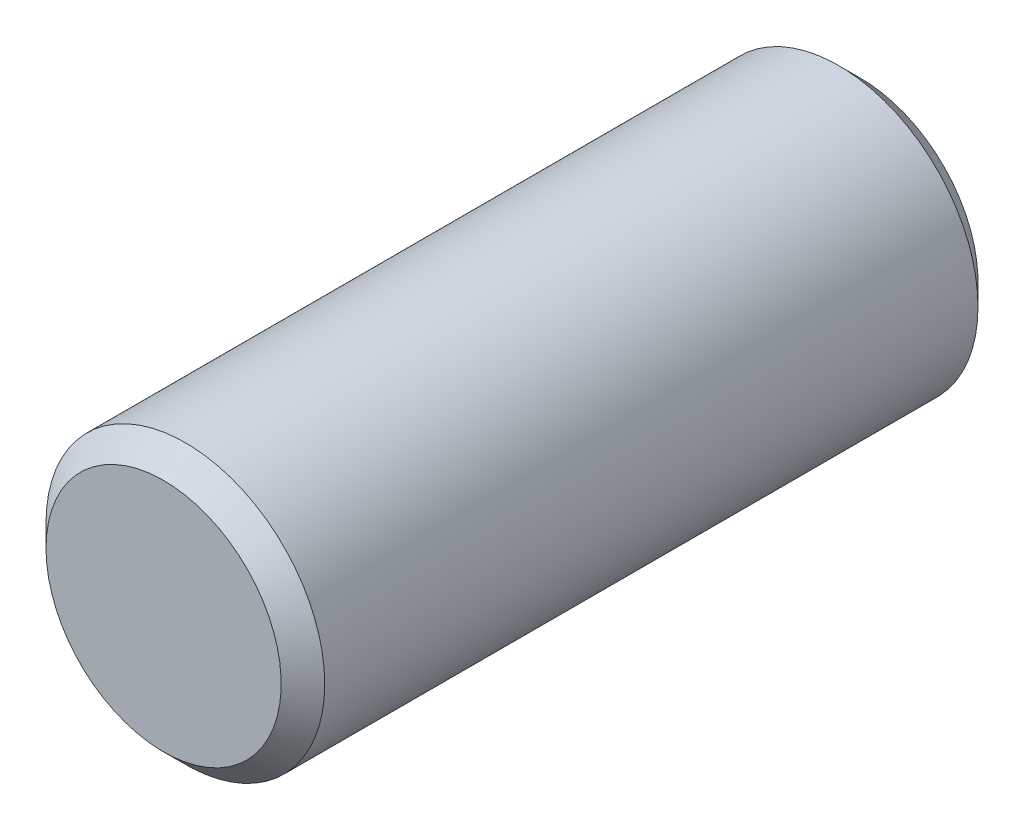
ISO-10303-21;
HEADER;
FILE_DESCRIPTION(('STEP AP214'),'2;1');
FILE_NAME('part.step','',(''),(''),'','','');
FILE_SCHEMA(('AUTOMOTIVE_DESIGN { 1 0 10303 214 1 1 1 1 }'));
ENDSEC;
DATA;
#1=APPLICATION_CONTEXT('core data for automotive mechanical design processes');
#2=APPLICATION_PROTOCOL_DEFINITION('international standard','automotive_design',2000,#1);
#3=PRODUCT_CONTEXT('',#1,'mechanical');
#4=PRODUCT('Part','Part','',(#3));
#5=PRODUCT_RELATED_PRODUCT_CATEGORY('part','',(#4));
#6=PRODUCT_DEFINITION_FORMATION('','',#4);
#7=PRODUCT_DEFINITION_CONTEXT('part definition',#1,'design');
#8=PRODUCT_DEFINITION('design','',#6,#7);
#9=PRODUCT_DEFINITION_SHAPE('','',#8);
#10=(LENGTH_UNIT() NAMED_UNIT(*) SI_UNIT(.MILLI.,.METRE.));
#11=(NAMED_UNIT(*) PLANE_ANGLE_UNIT() SI_UNIT($,.RADIAN.));
#12=(NAMED_UNIT(*) SI_UNIT($,.STERADIAN.) SOLID_ANGLE_UNIT());
#13=UNCERTAINTY_MEASURE_WITH_UNIT(LENGTH_MEASURE(1.E-05),#10,'distance_accuracy_value','');
#14=(GEOMETRIC_REPRESENTATION_CONTEXT(3) GLOBAL_UNCERTAINTY_ASSIGNED_CONTEXT((#13)) GLOBAL_UNIT_ASSIGNED_CONTEXT((#10,
#11,#12)) REPRESENTATION_CONTEXT('',''));
#15=CARTESIAN_POINT('',(0.,0.,0.));
#16=DIRECTION('',(0.,0.,1.));
#17=DIRECTION('',(1.,0.,0.));
#18=AXIS2_PLACEMENT_3D('',#15,#16,#17);
#19=CARTESIAN_POINT('',(0.,0.,0.));
#20=DIRECTION('',(0.,0.,-1.));
#21=DIRECTION('',(-1.,0.,0.));
#22=AXIS2_PLACEMENT_3D('',#19,#20,#21);
#23=PLANE('',#22);
#24=CARTESIAN_POINT('',(0.,0.,0.));
#25=DIRECTION('',(0.,0.,-1.));
#26=DIRECTION('',(-1.,0.,0.));
#27=AXIS2_PLACEMENT_3D('',#24,#25,#26);
#28=CIRCLE('',#27,3.375);
#29=CARTESIAN_POINT('',(-3.375,0.,0.));
#30=VERTEX_POINT('',#29);
#31=EDGE_CURVE('E11',#30,#30,#28,.T.);
#32=ORIENTED_EDGE('',*,*,#31,.T.);
#33=EDGE_LOOP('',(#32));
#34=FACE_BOUND('',#33,.T.);
#35=DIRECTION('',(0.866025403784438,-0.500000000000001,0.));
#36=VECTOR('',#35,1.);
#37=CARTESIAN_POINT('',(0.,2.29,0.));
#38=LINE('',#37,#36);
#39=CARTESIAN_POINT('',(0.,2.29,0.));
#40=VERTEX_POINT('',#39);
#41=CARTESIAN_POINT('',(1.98319817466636,1.145,0.));
#42=VERTEX_POINT('',#41);
#43=EDGE_CURVE('E107',#40,#42,#38,.T.);
#44=ORIENTED_EDGE('',*,*,#43,.F.);
#45=DIRECTION('',(-0.866025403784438,-0.500000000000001,0.));
#46=VECTOR('',#45,1.);
#47=CARTESIAN_POINT('',(0.,2.29,0.));
#48=LINE('',#47,#46);
#49=CARTESIAN_POINT('',(-1.98319817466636,1.145,0.));
#50=VERTEX_POINT('',#49);
#51=EDGE_CURVE('E43',#40,#50,#48,.T.);
#52=ORIENTED_EDGE('',*,*,#51,.T.);
#53=DIRECTION('',(0.,-1.,0.));
#54=VECTOR('',#53,1.);
#55=CARTESIAN_POINT('',(-1.98319817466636,1.145,0.));
#56=LINE('',#55,#54);
#57=CARTESIAN_POINT('',(-1.98319817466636,-1.145,0.));
#58=VERTEX_POINT('',#57);
#59=EDGE_CURVE('E187',#50,#58,#56,.T.);
#60=ORIENTED_EDGE('',*,*,#59,.T.);
#61=DIRECTION('',(0.866025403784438,-0.500000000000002,0.));
#62=VECTOR('',#61,1.);
#63=CARTESIAN_POINT('',(-1.98319817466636,-1.145,0.));
#64=LINE('',#63,#62);
#65=CARTESIAN_POINT('',(0.,-2.29,0.));
#66=VERTEX_POINT('',#65);
#67=EDGE_CURVE('E186',#58,#66,#64,.T.);
#68=ORIENTED_EDGE('',*,*,#67,.T.);
#69=DIRECTION('',(-0.866025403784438,-0.5,0.));
#70=VECTOR('',#69,1.);
#71=CARTESIAN_POINT('',(1.98319817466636,-1.145,0.));
#72=LINE('',#71,#70);
#73=CARTESIAN_POINT('',(1.98319817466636,-1.145,0.));
#74=VERTEX_POINT('',#73);
#75=EDGE_CURVE('E168',#74,#66,#72,.T.);
#76=ORIENTED_EDGE('',*,*,#75,.F.);
#77=DIRECTION('',(0.,-1.,0.));
#78=VECTOR('',#77,1.);
#79=CARTESIAN_POINT('',(1.98319817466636,1.145,0.));
#80=LINE('',#79,#78);
#81=EDGE_CURVE('E162',#42,#74,#80,.T.);
#82=ORIENTED_EDGE('',*,*,#81,.F.);
#83=EDGE_LOOP('',(#44,#52,#60,#68,#76,#82));
#84=FACE_BOUND('',#83,.T.);
#85=ADVANCED_FACE('F29',(#34,#84),#23,.T.);
#86=CARTESIAN_POINT('',(0.,0.,0.));
#87=DIRECTION('',(0.,0.,1.));
#88=DIRECTION('',(1.,0.,0.));
#89=AXIS2_PLACEMENT_3D('',#86,#87,#88);
#90=CONICAL_SURFACE('',#89,3.375,0.78539816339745);
#91=CARTESIAN_POINT('',(0.,0.,0.625));
#92=DIRECTION('',(0.,0.,-1.));
#93=DIRECTION('',(-1.,0.,0.));
#94=AXIS2_PLACEMENT_3D('',#91,#92,#93);
#95=CIRCLE('',#94,4.);
#96=CARTESIAN_POINT('',(-4.,0.,0.625));
#97=VERTEX_POINT('',#96);
#98=EDGE_CURVE('E36',#97,#97,#95,.T.);
#99=ORIENTED_EDGE('',*,*,#98,.T.);
#100=EDGE_LOOP('',(#99));
#101=FACE_BOUND('',#100,.T.);
#102=ORIENTED_EDGE('',*,*,#31,.F.);
#103=EDGE_LOOP('',(#102));
#104=FACE_BOUND('',#103,.T.);
#105=ADVANCED_FACE('F139',(#101,#104),#90,.T.);
#106=CARTESIAN_POINT('',(0.,0.,-10.));
#107=DIRECTION('',(0.,0.,-1.));
#108=DIRECTION('',(-1.,0.,0.));
#109=AXIS2_PLACEMENT_3D('',#106,#107,#108);
#110=CYLINDRICAL_SURFACE('',#109,4.);
#111=CARTESIAN_POINT('',(0.,0.,19.375));
#112=DIRECTION('',(0.,0.,-1.));
#113=DIRECTION('',(-1.,0.,0.));
#114=AXIS2_PLACEMENT_3D('',#111,#112,#113);
#115=CIRCLE('',#114,4.);
#116=CARTESIAN_POINT('',(-4.,0.,19.375));
#117=VERTEX_POINT('',#116);
#118=EDGE_CURVE('E134',#117,#117,#115,.T.);
#119=ORIENTED_EDGE('',*,*,#118,.T.);
#120=EDGE_LOOP('',(#119));
#121=FACE_BOUND('',#120,.T.);
#122=ORIENTED_EDGE('',*,*,#98,.F.);
#123=EDGE_LOOP('',(#122));
#124=FACE_BOUND('',#123,.T.);
#125=ADVANCED_FACE('F142',(#121,#124),#110,.T.);
#126=CARTESIAN_POINT('',(0.,0.,19.375));
#127=DIRECTION('',(0.,0.,-1.));
#128=DIRECTION('',(-1.,0.,0.));
#129=AXIS2_PLACEMENT_3D('',#126,#127,#128);
#130=CONICAL_SURFACE('',#129,4.,0.785398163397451);
#131=CARTESIAN_POINT('',(0.,0.,20.));
#132=DIRECTION('',(0.,0.,-1.));
#133=DIRECTION('',(-1.,0.,0.));
#134=AXIS2_PLACEMENT_3D('',#131,#132,#133);
#135=CIRCLE('',#134,3.375);
#136=CARTESIAN_POINT('',(-3.375,0.,20.));
#137=VERTEX_POINT('',#136);
#138=EDGE_CURVE('E131',#137,#137,#135,.T.);
#139=ORIENTED_EDGE('',*,*,#138,.T.);
#140=EDGE_LOOP('',(#139));
#141=FACE_BOUND('',#140,.T.);
#142=ORIENTED_EDGE('',*,*,#118,.F.);
#143=EDGE_LOOP('',(#142));
#144=FACE_BOUND('',#143,.T.);
#145=ADVANCED_FACE('F144',(#141,#144),#130,.T.);
#146=CARTESIAN_POINT('',(3.375,0.,20.));
#147=DIRECTION('',(0.,0.,1.));
#148=DIRECTION('',(1.,0.,0.));
#149=AXIS2_PLACEMENT_3D('',#146,#147,#148);
#150=PLANE('',#149);
#151=ORIENTED_EDGE('',*,*,#138,.F.);
#152=EDGE_LOOP('',(#151));
#153=FACE_BOUND('',#152,.T.);
#154=ADVANCED_FACE('F151',(#153),#150,.T.);
#155=CARTESIAN_POINT('',(0.,2.29,4.5));
#156=DIRECTION('',(0.500000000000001,-0.866025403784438,0.));
#157=DIRECTION('',(0.866025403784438,0.500000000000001,0.));
#158=AXIS2_PLACEMENT_3D('',#155,#156,#157);
#159=PLANE('',#158);
#160=ORIENTED_EDGE('',*,*,#51,.F.);
#161=DIRECTION('',(0.,0.,-1.));
#162=VECTOR('',#161,1.);
#163=CARTESIAN_POINT('',(0.,2.29,4.5));
#164=LINE('',#163,#162);
#165=CARTESIAN_POINT('',(0.,2.29,4.5));
#166=VERTEX_POINT('',#165);
#167=EDGE_CURVE('E101',#166,#40,#164,.T.);
#168=ORIENTED_EDGE('',*,*,#167,.F.);
#169=DIRECTION('',(-0.866025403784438,-0.500000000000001,0.));
#170=VECTOR('',#169,1.);
#171=CARTESIAN_POINT('',(0.,2.29,4.5));
#172=LINE('',#171,#170);
#173=CARTESIAN_POINT('',(-1.98319817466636,1.145,4.5));
#174=VERTEX_POINT('',#173);
#175=EDGE_CURVE('E163',#166,#174,#172,.T.);
#176=ORIENTED_EDGE('',*,*,#175,.T.);
#177=DIRECTION('',(0.,0.,-1.));
#178=VECTOR('',#177,1.);
#179=CARTESIAN_POINT('',(-1.98319817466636,1.145,4.5));
#180=LINE('',#179,#178);
#181=EDGE_CURVE('E129',#174,#50,#180,.T.);
#182=ORIENTED_EDGE('',*,*,#181,.T.);
#183=EDGE_LOOP('',(#160,#168,#176,#182));
#184=FACE_BOUND('',#183,.T.);
#185=ADVANCED_FACE('F208',(#184),#159,.T.);
#186=CARTESIAN_POINT('',(-1.98319817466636,1.145,4.5));
#187=DIRECTION('',(1.,0.,0.));
#188=DIRECTION('',(0.,0.,-1.));
#189=AXIS2_PLACEMENT_3D('',#186,#187,#188);
#190=PLANE('',#189);
#191=ORIENTED_EDGE('',*,*,#59,.F.);
#192=ORIENTED_EDGE('',*,*,#181,.F.);
#193=DIRECTION('',(0.,-1.,0.));
#194=VECTOR('',#193,1.);
#195=CARTESIAN_POINT('',(-1.98319817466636,1.145,4.5));
#196=LINE('',#195,#194);
#197=CARTESIAN_POINT('',(-1.98319817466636,-1.145,4.5));
#198=VERTEX_POINT('',#197);
#199=EDGE_CURVE('E166',#174,#198,#196,.T.);
#200=ORIENTED_EDGE('',*,*,#199,.T.);
#201=DIRECTION('',(0.,0.,-1.));
#202=VECTOR('',#201,1.);
#203=CARTESIAN_POINT('',(-1.98319817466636,-1.145,4.5));
#204=LINE('',#203,#202);
#205=EDGE_CURVE('E127',#198,#58,#204,.T.);
#206=ORIENTED_EDGE('',*,*,#205,.T.);
#207=EDGE_LOOP('',(#191,#192,#200,#206));
#208=FACE_BOUND('',#207,.T.);
#209=ADVANCED_FACE('F209',(#208),#190,.T.);
#210=CARTESIAN_POINT('',(-1.98319817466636,-1.145,4.5));
#211=DIRECTION('',(0.500000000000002,0.866025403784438,0.));
#212=DIRECTION('',(-0.866025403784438,0.500000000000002,0.));
#213=AXIS2_PLACEMENT_3D('',#210,#211,#212);
#214=PLANE('',#213);
#215=ORIENTED_EDGE('',*,*,#67,.F.);
#216=ORIENTED_EDGE('',*,*,#205,.F.);
#217=DIRECTION('',(0.866025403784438,-0.500000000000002,0.));
#218=VECTOR('',#217,1.);
#219=CARTESIAN_POINT('',(-1.98319817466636,-1.145,4.5));
#220=LINE('',#219,#218);
#221=CARTESIAN_POINT('',(0.,-2.29,4.5));
#222=VERTEX_POINT('',#221);
#223=EDGE_CURVE('E119',#198,#222,#220,.T.);
#224=ORIENTED_EDGE('',*,*,#223,.T.);
#225=DIRECTION('',(0.,0.,-1.));
#226=VECTOR('',#225,1.);
#227=CARTESIAN_POINT('',(0.,-2.29,4.5));
#228=LINE('',#227,#226);
#229=EDGE_CURVE('E125',#222,#66,#228,.T.);
#230=ORIENTED_EDGE('',*,*,#229,.T.);
#231=EDGE_LOOP('',(#215,#216,#224,#230));
#232=FACE_BOUND('',#231,.T.);
#233=ADVANCED_FACE('F178',(#232),#214,.T.);
#234=CARTESIAN_POINT('',(1.98319817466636,-1.145,4.5));
#235=DIRECTION('',(0.5,-0.866025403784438,0.));
#236=DIRECTION('',(0.866025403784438,0.5,0.));
#237=AXIS2_PLACEMENT_3D('',#234,#235,#236);
#238=PLANE('',#237);
#239=ORIENTED_EDGE('',*,*,#75,.T.);
#240=ORIENTED_EDGE('',*,*,#229,.F.);
#241=DIRECTION('',(-0.866025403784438,-0.5,0.));
#242=VECTOR('',#241,1.);
#243=CARTESIAN_POINT('',(1.98319817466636,-1.145,4.5));
#244=LINE('',#243,#242);
#245=CARTESIAN_POINT('',(1.98319817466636,-1.145,4.5));
#246=VERTEX_POINT('',#245);
#247=EDGE_CURVE('E116',#246,#222,#244,.T.);
#248=ORIENTED_EDGE('',*,*,#247,.F.);
#249=DIRECTION('',(0.,0.,-1.));
#250=VECTOR('',#249,1.);
#251=CARTESIAN_POINT('',(1.98319817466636,-1.145,4.5));
#252=LINE('',#251,#250);
#253=EDGE_CURVE('E111',#246,#74,#252,.T.);
#254=ORIENTED_EDGE('',*,*,#253,.T.);
#255=EDGE_LOOP('',(#239,#240,#248,#254));
#256=FACE_BOUND('',#255,.T.);
#257=ADVANCED_FACE('F184',(#256),#238,.F.);
#258=CARTESIAN_POINT('',(1.98319817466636,1.145,4.5));
#259=DIRECTION('',(1.,0.,0.));
#260=DIRECTION('',(0.,0.,-1.));
#261=AXIS2_PLACEMENT_3D('',#258,#259,#260);
#262=PLANE('',#261);
#263=ORIENTED_EDGE('',*,*,#81,.T.);
#264=ORIENTED_EDGE('',*,*,#253,.F.);
#265=DIRECTION('',(0.,-1.,0.));
#266=VECTOR('',#265,1.);
#267=CARTESIAN_POINT('',(1.98319817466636,1.145,4.5));
#268=LINE('',#267,#266);
#269=CARTESIAN_POINT('',(1.98319817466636,1.145,4.5));
#270=VERTEX_POINT('',#269);
#271=EDGE_CURVE('E51',#270,#246,#268,.T.);
#272=ORIENTED_EDGE('',*,*,#271,.F.);
#273=DIRECTION('',(0.,0.,-1.));
#274=VECTOR('',#273,1.);
#275=CARTESIAN_POINT('',(1.98319817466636,1.145,4.5));
#276=LINE('',#275,#274);
#277=EDGE_CURVE('E104',#270,#42,#276,.T.);
#278=ORIENTED_EDGE('',*,*,#277,.T.);
#279=EDGE_LOOP('',(#263,#264,#272,#278));
#280=FACE_BOUND('',#279,.T.);
#281=ADVANCED_FACE('F114',(#280),#262,.F.);
#282=CARTESIAN_POINT('',(0.,2.29,4.5));
#283=DIRECTION('',(0.500000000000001,0.866025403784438,0.));
#284=DIRECTION('',(-0.866025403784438,0.500000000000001,0.));
#285=AXIS2_PLACEMENT_3D('',#282,#283,#284);
#286=PLANE('',#285);
#287=ORIENTED_EDGE('',*,*,#43,.T.);
#288=ORIENTED_EDGE('',*,*,#277,.F.);
#289=DIRECTION('',(0.866025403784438,-0.500000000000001,0.));
#290=VECTOR('',#289,1.);
#291=CARTESIAN_POINT('',(0.,2.29,4.5));
#292=LINE('',#291,#290);
#293=EDGE_CURVE('E94',#166,#270,#292,.T.);
#294=ORIENTED_EDGE('',*,*,#293,.F.);
#295=ORIENTED_EDGE('',*,*,#167,.T.);
#296=EDGE_LOOP('',(#287,#288,#294,#295));
#297=FACE_BOUND('',#296,.T.);
#298=ADVANCED_FACE('F105',(#297),#286,.F.);
#299=CARTESIAN_POINT('',(0.,2.29,4.5));
#300=DIRECTION('',(0.122234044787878,-0.211715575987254,-0.969657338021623));
#301=DIRECTION('',(0.,0.976983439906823,-0.213315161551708));
#302=AXIS2_PLACEMENT_3D('',#299,#300,#301);
#303=PLANE('',#302);
#304=DIRECTION('',(0.,0.976983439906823,-0.213315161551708));
#305=VECTOR('',#304,1.);
#306=CARTESIAN_POINT('',(0.,0.,5.));
#307=LINE('',#306,#305);
#308=CARTESIAN_POINT('',(0.,0.,5.));
#309=VERTEX_POINT('',#308);
#310=EDGE_CURVE('E98',#309,#166,#307,.T.);
#311=ORIENTED_EDGE('',*,*,#310,.F.);
#312=DIRECTION('',(-0.846092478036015,0.488491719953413,-0.213315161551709));
#313=VECTOR('',#312,1.);
#314=CARTESIAN_POINT('',(0.,0.,5.));
#315=LINE('',#314,#313);
#316=EDGE_CURVE('E192',#309,#174,#315,.T.);
#317=ORIENTED_EDGE('',*,*,#316,.T.);
#318=ORIENTED_EDGE('',*,*,#175,.F.);
#319=EDGE_LOOP('',(#311,#317,#318));
#320=FACE_BOUND('',#319,.T.);
#321=ADVANCED_FACE('F200',(#320),#303,.T.);
#322=CARTESIAN_POINT('',(-1.98319817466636,1.145,4.5));
#323=DIRECTION('',(0.244468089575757,0.,-0.969657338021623));
#324=DIRECTION('',(-0.969657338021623,0.,-0.244468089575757));
#325=AXIS2_PLACEMENT_3D('',#322,#323,#324);
#326=PLANE('',#325);
#327=ORIENTED_EDGE('',*,*,#316,.F.);
#328=DIRECTION('',(-0.846092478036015,-0.488491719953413,-0.213315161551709));
#329=VECTOR('',#328,1.);
#330=CARTESIAN_POINT('',(0.,0.,5.));
#331=LINE('',#330,#329);
#332=EDGE_CURVE('E90',#309,#198,#331,.T.);
#333=ORIENTED_EDGE('',*,*,#332,.T.);
#334=ORIENTED_EDGE('',*,*,#199,.F.);
#335=EDGE_LOOP('',(#327,#333,#334));
#336=FACE_BOUND('',#335,.T.);
#337=ADVANCED_FACE('F205',(#336),#326,.T.);
#338=CARTESIAN_POINT('',(1.98319817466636,1.145,4.5));
#339=DIRECTION('',(-0.122234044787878,-0.211715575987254,-0.969657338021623));
#340=DIRECTION('',(0.,0.976983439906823,-0.213315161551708));
#341=AXIS2_PLACEMENT_3D('',#338,#339,#340);
#342=PLANE('',#341);
#343=DIRECTION('',(0.846092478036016,0.488491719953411,-0.213315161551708));
#344=VECTOR('',#343,1.);
#345=CARTESIAN_POINT('',(0.,0.,5.));
#346=LINE('',#345,#344);
#347=EDGE_CURVE('E84',#309,#270,#346,.T.);
#348=ORIENTED_EDGE('',*,*,#347,.F.);
#349=ORIENTED_EDGE('',*,*,#310,.T.);
#350=ORIENTED_EDGE('',*,*,#293,.T.);
#351=EDGE_LOOP('',(#348,#349,#350));
#352=FACE_BOUND('',#351,.T.);
#353=ADVANCED_FACE('F96',(#352),#342,.T.);
#354=CARTESIAN_POINT('',(-1.98319817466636,-1.145,4.5));
#355=DIRECTION('',(0.122234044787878,0.211715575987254,-0.969657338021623));
#356=DIRECTION('',(0.,0.976983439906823,0.213315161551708));
#357=AXIS2_PLACEMENT_3D('',#354,#355,#356);
#358=PLANE('',#357);
#359=ORIENTED_EDGE('',*,*,#332,.F.);
#360=DIRECTION('',(0.,-0.976983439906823,-0.213315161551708));
#361=VECTOR('',#360,1.);
#362=CARTESIAN_POINT('',(0.,0.,5.));
#363=LINE('',#362,#361);
#364=EDGE_CURVE('E91',#309,#222,#363,.T.);
#365=ORIENTED_EDGE('',*,*,#364,.T.);
#366=ORIENTED_EDGE('',*,*,#223,.F.);
#367=EDGE_LOOP('',(#359,#365,#366));
#368=FACE_BOUND('',#367,.T.);
#369=ADVANCED_FACE('F203',(#368),#358,.T.);
#370=CARTESIAN_POINT('',(1.98319817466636,-1.145,4.5));
#371=DIRECTION('',(-0.244468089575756,0.,-0.969657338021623));
#372=DIRECTION('',(-0.969657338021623,0.,0.244468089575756));
#373=AXIS2_PLACEMENT_3D('',#370,#371,#372);
#374=PLANE('',#373);
#375=DIRECTION('',(0.846092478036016,-0.488491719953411,-0.213315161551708));
#376=VECTOR('',#375,1.);
#377=CARTESIAN_POINT('',(0.,0.,5.));
#378=LINE('',#377,#376);
#379=EDGE_CURVE('E87',#309,#246,#378,.T.);
#380=ORIENTED_EDGE('',*,*,#379,.F.);
#381=ORIENTED_EDGE('',*,*,#347,.T.);
#382=ORIENTED_EDGE('',*,*,#271,.T.);
#383=EDGE_LOOP('',(#380,#381,#382));
#384=FACE_BOUND('',#383,.T.);
#385=ADVANCED_FACE('F86',(#384),#374,.T.);
#386=CARTESIAN_POINT('',(0.,-2.29,4.5));
#387=DIRECTION('',(-0.122234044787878,0.211715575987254,-0.969657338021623));
#388=DIRECTION('',(0.,0.976983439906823,0.213315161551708));
#389=AXIS2_PLACEMENT_3D('',#386,#387,#388);
#390=PLANE('',#389);
#391=ORIENTED_EDGE('',*,*,#364,.F.);
#392=ORIENTED_EDGE('',*,*,#379,.T.);
#393=ORIENTED_EDGE('',*,*,#247,.T.);
#394=EDGE_LOOP('',(#391,#392,#393));
#395=FACE_BOUND('',#394,.T.);
#396=ADVANCED_FACE('F198',(#395),#390,.T.);
#397=CLOSED_SHELL('',(#85,#105,#125,#145,#154,#185,#209,#233,#257,#281,#298,#321,#337,#353,#369,
#385,#396));
#398=MANIFOLD_SOLID_BREP('B2',#397);
#399=ADVANCED_BREP_SHAPE_REPRESENTATION('',(#18,#398),#14);
#400=SHAPE_DEFINITION_REPRESENTATION(#9,#399);
ENDSEC;
END-ISO-10303-21;
